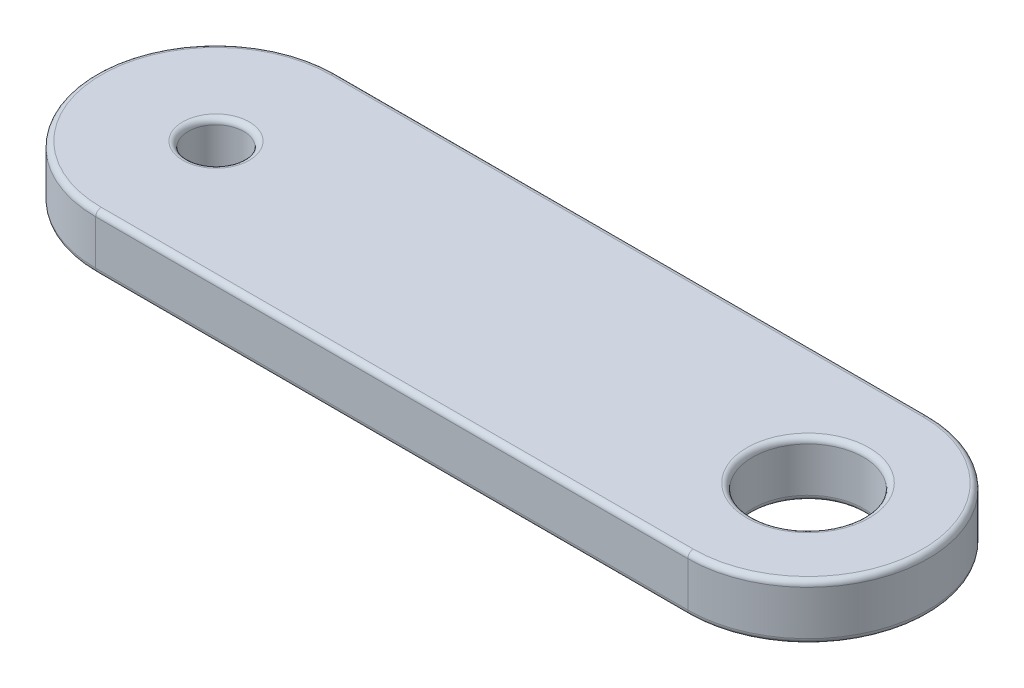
from build123d import *

# Parameters (mm, degrees)
SKETCH1_R           = 0.75
SKETCH1_R_2         = 1.5
BOSS_EXTRUDE1_DEPTH = 0.75
FILLET1_R           = 0.15


with BuildPart() as part:
    # Sketch1 → Boss-Extrude1 (new, symmetric)
    with BuildSketch(Plane(origin=(0, 0, 0), x_dir=(1, 0, 0), z_dir=(0, 1, 0))):
        with BuildLine():
            Line((-8, 3.25), (8, 3.25))
            ThreePointArc((8, 3.25), (11.25, 0), (8, -3.25))
            Line((8, -3.25), (-8, -3.25))
            ThreePointArc((-8, -3.25), (-11.25, 0), (-8, 3.25))
        make_face()
        with Locations(Location((-8, 0, 0), (0, 0, 270))):
            Circle(SKETCH1_R, mode=Mode.SUBTRACT)
        with Locations(Location((8, 0, 0), (0, 0, 270))):
            Circle(SKETCH1_R_2, mode=Mode.SUBTRACT)
    extrude(amount=BOSS_EXTRUDE1_DEPTH, both=True)

    # Fillet1
    fillet1_edges = [part.edges().sort_by_distance(p)[0] for p in [
        (11.25, 0.75, 0),
        (-8, -0.75, -0.75),
        (-8, 0.75, -0.75),
        (0, 0.75, -3.25),
        (8, -0.75, -1.5),
        (8, 0.75, -1.5),
        (-11.25, 0.75, 0),
        (0, -0.75, -3.25),
        (11.25, -0.75, 0),
        (0, -0.75, 3.25),
        (-11.25, -0.75, 0),
        (0, 0.75, 3.25),
    ]]
    fillet(fillet1_edges, radius=FILLET1_R)


solid = part.part
